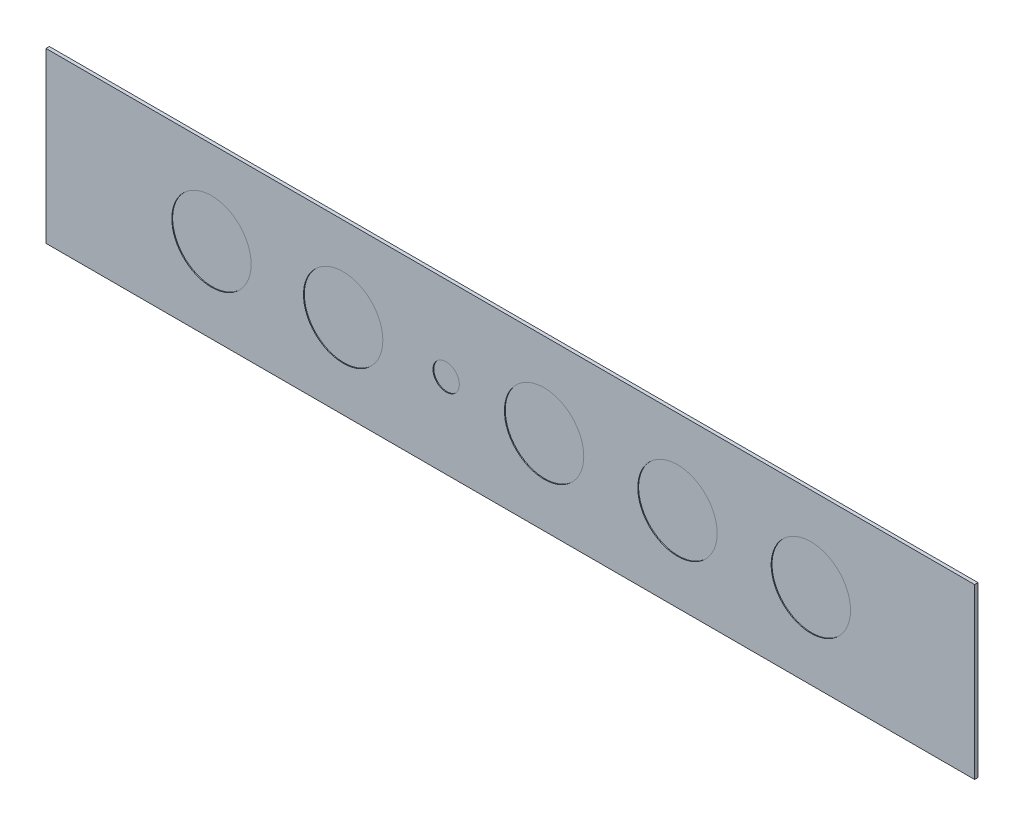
from build123d import *

# Parameters (mm, degrees)
SKETCH1_W           = 139.7
SKETCH1_H           = 25.4
BOSS_EXTRUDE1_DEPTH = 0.508
SKETCH2_R           = 5.969
SKETCH2_R_2         = 1.9812
CUT_EXTRUDE1_DEPTH  = 0.127


with BuildPart() as part:
    # Sketch1 → Boss-Extrude1 (new body)
    with BuildSketch(Plane.XY):
        Rectangle(SKETCH1_W, SKETCH1_H)
    extrude(amount=BOSS_EXTRUDE1_DEPTH)

    # Sketch2 → Cut-Extrude1 (cut)
    with BuildSketch(Plane.XY.offset(0.508)):
        with Locations((-44.958, 0)):
            Circle(SKETCH2_R)
        with Locations((-25.146, 0)):
            Circle(SKETCH2_R)
        with Locations((-9.652, 0)):
            Circle(SKETCH2_R_2)
        with Locations((5.08, 0)):
            Circle(SKETCH2_R)
        with Locations((25.146, 0)):
            Circle(SKETCH2_R)
        with Locations((45.212, 0)):
            Circle(SKETCH2_R)
    extrude(amount=-CUT_EXTRUDE1_DEPTH, mode=Mode.SUBTRACT)


solid = part.part
